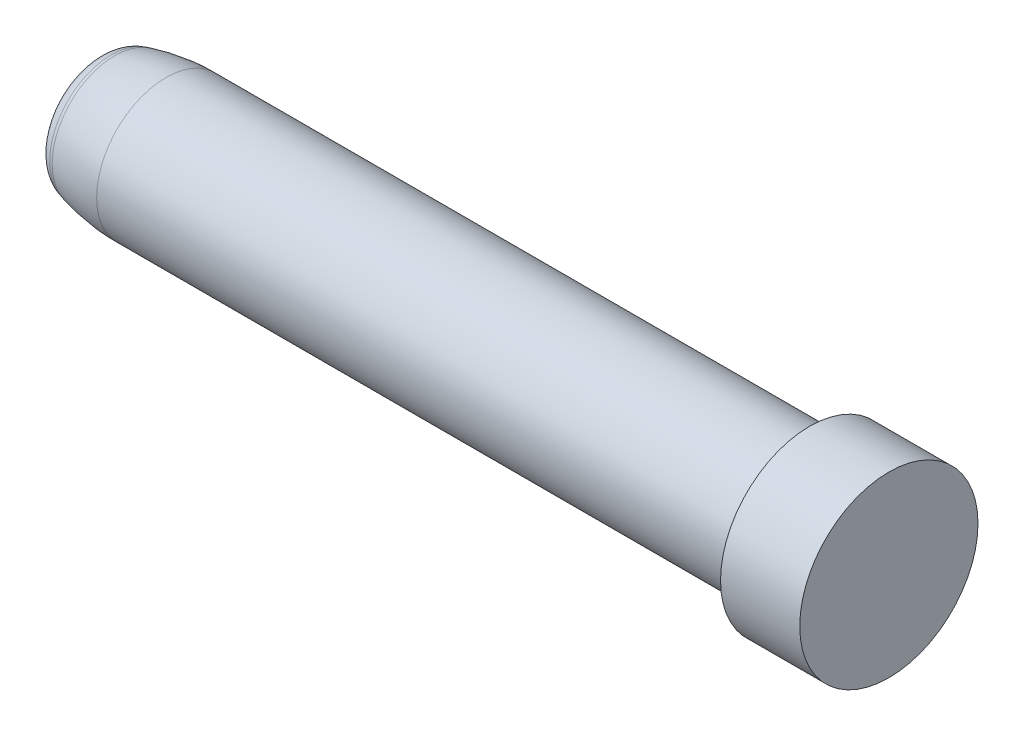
ISO-10303-21;
HEADER;
FILE_DESCRIPTION(('STEP AP214'),'2;1');
FILE_NAME('part.step','',(''),(''),'','','');
FILE_SCHEMA(('AUTOMOTIVE_DESIGN { 1 0 10303 214 1 1 1 1 }'));
ENDSEC;
DATA;
#1=APPLICATION_CONTEXT('core data for automotive mechanical design processes');
#2=APPLICATION_PROTOCOL_DEFINITION('international standard','automotive_design',2000,#1);
#3=PRODUCT_CONTEXT('',#1,'mechanical');
#4=PRODUCT('Part','Part','',(#3));
#5=PRODUCT_RELATED_PRODUCT_CATEGORY('part','',(#4));
#6=PRODUCT_DEFINITION_FORMATION('','',#4);
#7=PRODUCT_DEFINITION_CONTEXT('part definition',#1,'design');
#8=PRODUCT_DEFINITION('design','',#6,#7);
#9=PRODUCT_DEFINITION_SHAPE('','',#8);
#10=(LENGTH_UNIT() NAMED_UNIT(*) SI_UNIT(.MILLI.,.METRE.));
#11=(NAMED_UNIT(*) PLANE_ANGLE_UNIT() SI_UNIT($,.RADIAN.));
#12=(NAMED_UNIT(*) SI_UNIT($,.STERADIAN.) SOLID_ANGLE_UNIT());
#13=UNCERTAINTY_MEASURE_WITH_UNIT(LENGTH_MEASURE(1.E-05),#10,'distance_accuracy_value','');
#14=(GEOMETRIC_REPRESENTATION_CONTEXT(3) GLOBAL_UNCERTAINTY_ASSIGNED_CONTEXT((#13)) GLOBAL_UNIT_ASSIGNED_CONTEXT((#10,
#11,#12)) REPRESENTATION_CONTEXT('',''));
#15=CARTESIAN_POINT('',(0.,0.,0.));
#16=DIRECTION('',(0.,0.,1.));
#17=DIRECTION('',(1.,0.,0.));
#18=AXIS2_PLACEMENT_3D('',#15,#16,#17);
#19=CARTESIAN_POINT('',(0.,4.5,0.));
#20=DIRECTION('',(1.,0.,0.));
#21=DIRECTION('',(0.,0.,-1.));
#22=AXIS2_PLACEMENT_3D('',#19,#20,#21);
#23=PLANE('',#22);
#24=CARTESIAN_POINT('',(0.,0.,0.));
#25=DIRECTION('',(1.,0.,0.));
#26=DIRECTION('',(0.,0.,-1.));
#27=AXIS2_PLACEMENT_3D('',#24,#25,#26);
#28=CIRCLE('',#27,9.);
#29=CARTESIAN_POINT('',(0.,0.,-9.00000000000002));
#30=VERTEX_POINT('',#29);
#31=EDGE_CURVE('E47',#30,#30,#28,.F.);
#32=ORIENTED_EDGE('',*,*,#31,.F.);
#33=EDGE_LOOP('',(#32));
#34=FACE_BOUND('',#33,.T.);
#35=ADVANCED_FACE('F14',(#34),#23,.T.);
#36=CARTESIAN_POINT('',(-80.0000000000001,2.14761264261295,0.));
#37=DIRECTION('',(-1.,0.,0.));
#38=DIRECTION('',(0.,0.,1.));
#39=AXIS2_PLACEMENT_3D('',#36,#37,#38);
#40=PLANE('',#39);
#41=CARTESIAN_POINT('',(-80.0000000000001,0.,0.));
#42=DIRECTION('',(1.,0.,0.));
#43=DIRECTION('',(0.,0.,1.));
#44=AXIS2_PLACEMENT_3D('',#41,#42,#43);
#45=CIRCLE('',#44,4.2952252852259);
#46=CARTESIAN_POINT('',(-80.0000000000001,0.,4.29522528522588));
#47=VERTEX_POINT('',#46);
#48=CARTESIAN_POINT('',(-80.0000000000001,0.,-4.29522528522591));
#49=VERTEX_POINT('',#48);
#50=EDGE_CURVE('E41',#47,#49,#45,.T.);
#51=ORIENTED_EDGE('',*,*,#50,.F.);
#52=CARTESIAN_POINT('',(-80.0000000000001,0.,0.));
#53=DIRECTION('',(1.,0.,0.));
#54=DIRECTION('',(0.,1.,0.));
#55=AXIS2_PLACEMENT_3D('',#52,#53,#54);
#56=CIRCLE('',#55,4.2952252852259);
#57=CARTESIAN_POINT('',(-80.0000000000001,4.29522528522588,0.));
#58=VERTEX_POINT('',#57);
#59=EDGE_CURVE('E36',#58,#47,#56,.T.);
#60=ORIENTED_EDGE('',*,*,#59,.F.);
#61=CARTESIAN_POINT('',(-80.0000000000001,0.,0.));
#62=DIRECTION('',(1.,0.,0.));
#63=DIRECTION('',(0.,0.,-1.));
#64=AXIS2_PLACEMENT_3D('',#61,#62,#63);
#65=CIRCLE('',#64,4.2952252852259);
#66=EDGE_CURVE('E44',#49,#58,#65,.T.);
#67=ORIENTED_EDGE('',*,*,#66,.F.);
#68=EDGE_LOOP('',(#51,#60,#67));
#69=FACE_BOUND('',#68,.T.);
#70=ADVANCED_FACE('F43',(#69),#40,.T.);
#71=CARTESIAN_POINT('',(-4.,0.,0.));
#72=DIRECTION('',(1.,0.,0.));
#73=DIRECTION('',(0.,0.,-1.));
#74=AXIS2_PLACEMENT_3D('',#71,#72,#73);
#75=CYLINDRICAL_SURFACE('',#74,9.);
#76=CARTESIAN_POINT('',(-8.00000000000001,0.,0.));
#77=DIRECTION('',(1.,0.,0.));
#78=DIRECTION('',(0.,0.,-1.));
#79=AXIS2_PLACEMENT_3D('',#76,#77,#78);
#80=CIRCLE('',#79,9.);
#81=CARTESIAN_POINT('',(-8.00000000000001,0.,-9.00000000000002));
#82=VERTEX_POINT('',#81);
#83=EDGE_CURVE('E54',#82,#82,#80,.F.);
#84=ORIENTED_EDGE('',*,*,#83,.F.);
#85=EDGE_LOOP('',(#84));
#86=FACE_BOUND('',#85,.T.);
#87=ORIENTED_EDGE('',*,*,#31,.T.);
#88=EDGE_LOOP('',(#87));
#89=FACE_BOUND('',#88,.T.);
#90=ADVANCED_FACE('F73',(#86,#89),#75,.T.);
#91=CARTESIAN_POINT('',(-78.0000000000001,0.,0.));
#92=DIRECTION('',(-1.,0.,0.));
#93=DIRECTION('',(0.,0.,1.));
#94=AXIS2_PLACEMENT_3D('',#91,#92,#93);
#95=TOROIDAL_SURFACE('',#94,4.2952252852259,2.);
#96=CARTESIAN_POINT('',(-78.5176380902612,0.,0.));
#97=DIRECTION('',(1.,0.,0.));
#98=DIRECTION('',(0.,1.,0.));
#99=AXIS2_PLACEMENT_3D('',#96,#97,#98);
#100=CIRCLE('',#99,6.22707693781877);
#101=CARTESIAN_POINT('',(-78.5176380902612,6.22707693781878,0.));
#102=VERTEX_POINT('',#101);
#103=EDGE_CURVE('E57',#102,#102,#100,.T.);
#104=ORIENTED_EDGE('',*,*,#103,.F.);
#105=EDGE_LOOP('',(#104));
#106=FACE_BOUND('',#105,.T.);
#107=ORIENTED_EDGE('',*,*,#66,.T.);
#108=ORIENTED_EDGE('',*,*,#59,.T.);
#109=ORIENTED_EDGE('',*,*,#50,.T.);
#110=EDGE_LOOP('',(#107,#108,#109));
#111=FACE_BOUND('',#110,.T.);
#112=ADVANCED_FACE('F51',(#106,#111),#95,.T.);
#113=CARTESIAN_POINT('',(-8.00000000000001,7.90000000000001,0.));
#114=DIRECTION('',(-1.,0.,0.));
#115=DIRECTION('',(0.,0.,1.));
#116=AXIS2_PLACEMENT_3D('',#113,#114,#115);
#117=PLANE('',#116);
#118=ORIENTED_EDGE('',*,*,#83,.T.);
#119=EDGE_LOOP('',(#118));
#120=FACE_BOUND('',#119,.T.);
#121=CARTESIAN_POINT('',(-8.00000000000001,0.,0.));
#122=DIRECTION('',(1.,0.,0.));
#123=DIRECTION('',(0.,0.,-1.));
#124=AXIS2_PLACEMENT_3D('',#121,#122,#123);
#125=CIRCLE('',#124,6.8);
#126=CARTESIAN_POINT('',(-8.00000000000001,0.,-6.80000000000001));
#127=VERTEX_POINT('',#126);
#128=EDGE_CURVE('E115',#127,#127,#125,.F.);
#129=ORIENTED_EDGE('',*,*,#128,.F.);
#130=EDGE_LOOP('',(#129));
#131=FACE_BOUND('',#130,.T.);
#132=ADVANCED_FACE('F72',(#120,#131),#117,.T.);
#133=CARTESIAN_POINT('',(-78.1763809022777,0.,0.));
#134=DIRECTION('',(1.,0.,0.));
#135=DIRECTION('',(0.,0.,-1.));
#136=AXIS2_PLACEMENT_3D('',#133,#134,#135);
#137=CONICAL_SURFACE('',#136,6.318516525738,0.261799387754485);
#138=CARTESIAN_POINT('',(-78.1763809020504,0.,0.));
#139=DIRECTION('',(-1.,0.,0.));
#140=DIRECTION('',(0.,0.,1.));
#141=AXIS2_PLACEMENT_3D('',#138,#139,#140);
#142=CIRCLE('',#141,6.31851652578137);
#143=CARTESIAN_POINT('',(-78.1763809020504,0.,6.31851652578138));
#144=VERTEX_POINT('',#143);
#145=EDGE_CURVE('E107',#144,#144,#142,.F.);
#146=ORIENTED_EDGE('',*,*,#145,.F.);
#147=EDGE_LOOP('',(#146));
#148=FACE_BOUND('',#147,.T.);
#149=ORIENTED_EDGE('',*,*,#103,.T.);
#150=EDGE_LOOP('',(#149));
#151=FACE_BOUND('',#150,.T.);
#152=ADVANCED_FACE('F156',(#148,#151),#137,.T.);
#153=CARTESIAN_POINT('',(-8.29999999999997,0.,0.));
#154=DIRECTION('',(1.,0.,0.));
#155=DIRECTION('',(0.,0.,-1.));
#156=AXIS2_PLACEMENT_3D('',#153,#154,#155);
#157=CYLINDRICAL_SURFACE('',#156,6.8);
#158=CARTESIAN_POINT('',(-8.59999999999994,0.,0.));
#159=DIRECTION('',(1.,0.,0.));
#160=DIRECTION('',(0.,0.,-1.));
#161=AXIS2_PLACEMENT_3D('',#158,#159,#160);
#162=CIRCLE('',#161,6.8);
#163=CARTESIAN_POINT('',(-8.59999999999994,0.,-6.80000000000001));
#164=VERTEX_POINT('',#163);
#165=EDGE_CURVE('E102',#164,#164,#162,.F.);
#166=ORIENTED_EDGE('',*,*,#165,.F.);
#167=EDGE_LOOP('',(#166));
#168=FACE_BOUND('',#167,.T.);
#169=ORIENTED_EDGE('',*,*,#128,.T.);
#170=EDGE_LOOP('',(#169));
#171=FACE_BOUND('',#170,.T.);
#172=ADVANCED_FACE('F91',(#168,#171),#157,.T.);
#173=CARTESIAN_POINT('',(-73.,0.,-13.));
#174=DIRECTION('',(0.,1.,0.));
#175=DIRECTION('',(0.,0.,1.));
#176=AXIS2_PLACEMENT_3D('',#173,#174,#175);
#177=CIRCLE('',#176,20.);
#178=TRIMMED_CURVE('',#177,(PARAMETER_VALUE(-0.863211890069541)),
(PARAMETER_VALUE(0.863211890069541)),.T.,.PARAMETER.);
#179=CARTESIAN_POINT('',(-73.,0.,0.));
#180=DIRECTION('',(-1.,0.,0.));
#181=AXIS1_PLACEMENT('',#179,#180);
#182=SURFACE_OF_REVOLUTION('',#178,#181);
#183=ORIENTED_EDGE('',*,*,#145,.T.);
#184=EDGE_LOOP('',(#183));
#185=FACE_BOUND('',#184,.T.);
#186=CARTESIAN_POINT('',(-73.,0.,0.));
#187=DIRECTION('',(1.,0.,0.));
#188=DIRECTION('',(0.,0.,-1.));
#189=AXIS2_PLACEMENT_3D('',#186,#187,#188);
#190=CIRCLE('',#189,7.);
#191=CARTESIAN_POINT('',(-73.,0.,-7.00000000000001));
#192=VERTEX_POINT('',#191);
#193=EDGE_CURVE('E27',#192,#192,#190,.T.);
#194=ORIENTED_EDGE('',*,*,#193,.F.);
#195=EDGE_LOOP('',(#194));
#196=FACE_BOUND('',#195,.T.);
#197=ADVANCED_FACE('F87',(#185,#196),#182,.F.);
#198=CARTESIAN_POINT('',(-8.59999999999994,6.90000000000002,0.));
#199=DIRECTION('',(1.,0.,0.));
#200=DIRECTION('',(0.,0.,-1.));
#201=AXIS2_PLACEMENT_3D('',#198,#199,#200);
#202=PLANE('',#201);
#203=ORIENTED_EDGE('',*,*,#165,.T.);
#204=EDGE_LOOP('',(#203));
#205=FACE_BOUND('',#204,.T.);
#206=CARTESIAN_POINT('',(-8.59999999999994,0.,0.));
#207=DIRECTION('',(1.,0.,0.));
#208=DIRECTION('',(0.,0.,-1.));
#209=AXIS2_PLACEMENT_3D('',#206,#207,#208);
#210=CIRCLE('',#209,7.);
#211=CARTESIAN_POINT('',(-8.59999999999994,0.,-7.00000000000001));
#212=VERTEX_POINT('',#211);
#213=EDGE_CURVE('E9',#212,#212,#210,.F.);
#214=ORIENTED_EDGE('',*,*,#213,.F.);
#215=EDGE_LOOP('',(#214));
#216=FACE_BOUND('',#215,.T.);
#217=ADVANCED_FACE('F90',(#205,#216),#202,.T.);
#218=CARTESIAN_POINT('',(-40.7999999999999,0.,0.));
#219=DIRECTION('',(1.,0.,0.));
#220=DIRECTION('',(0.,0.,-1.));
#221=AXIS2_PLACEMENT_3D('',#218,#219,#220);
#222=CYLINDRICAL_SURFACE('',#221,7.);
#223=ORIENTED_EDGE('',*,*,#193,.T.);
#224=EDGE_LOOP('',(#223));
#225=FACE_BOUND('',#224,.T.);
#226=ORIENTED_EDGE('',*,*,#213,.T.);
#227=EDGE_LOOP('',(#226));
#228=FACE_BOUND('',#227,.T.);
#229=ADVANCED_FACE('F16',(#225,#228),#222,.T.);
#230=CLOSED_SHELL('',(#35,#70,#90,#112,#132,#152,#172,#197,#217,#229));
#231=MANIFOLD_SOLID_BREP('B1',#230);
#232=ADVANCED_BREP_SHAPE_REPRESENTATION('',(#18,#231),#14);
#233=SHAPE_DEFINITION_REPRESENTATION(#9,#232);
ENDSEC;
END-ISO-10303-21;
